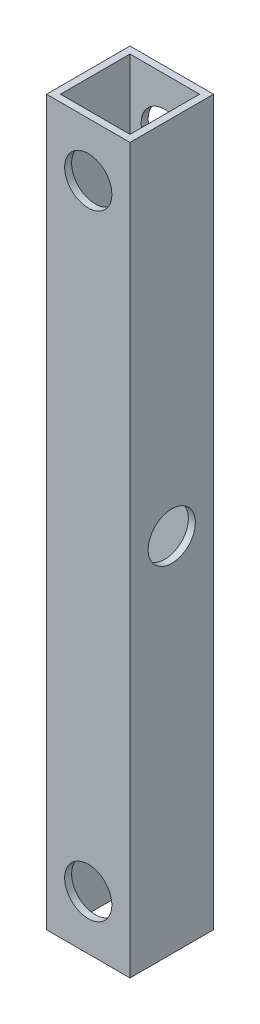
ISO-10303-21;
HEADER;
FILE_DESCRIPTION(('STEP AP214'),'2;1');
FILE_NAME('part.step','',(''),(''),'','','');
FILE_SCHEMA(('AUTOMOTIVE_DESIGN { 1 0 10303 214 1 1 1 1 }'));
ENDSEC;
DATA;
#1=APPLICATION_CONTEXT('core data for automotive mechanical design processes');
#2=APPLICATION_PROTOCOL_DEFINITION('international standard','automotive_design',2000,#1);
#3=PRODUCT_CONTEXT('',#1,'mechanical');
#4=PRODUCT('Part','Part','',(#3));
#5=PRODUCT_RELATED_PRODUCT_CATEGORY('part','',(#4));
#6=PRODUCT_DEFINITION_FORMATION('','',#4);
#7=PRODUCT_DEFINITION_CONTEXT('part definition',#1,'design');
#8=PRODUCT_DEFINITION('design','',#6,#7);
#9=PRODUCT_DEFINITION_SHAPE('','',#8);
#10=(LENGTH_UNIT() NAMED_UNIT(*) SI_UNIT(.MILLI.,.METRE.));
#11=(NAMED_UNIT(*) PLANE_ANGLE_UNIT() SI_UNIT($,.RADIAN.));
#12=(NAMED_UNIT(*) SI_UNIT($,.STERADIAN.) SOLID_ANGLE_UNIT());
#13=UNCERTAINTY_MEASURE_WITH_UNIT(LENGTH_MEASURE(1.E-05),#10,'distance_accuracy_value','');
#14=(GEOMETRIC_REPRESENTATION_CONTEXT(3) GLOBAL_UNCERTAINTY_ASSIGNED_CONTEXT((#13)) GLOBAL_UNIT_ASSIGNED_CONTEXT((#10,
#11,#12)) REPRESENTATION_CONTEXT('',''));
#15=CARTESIAN_POINT('',(0.,0.,0.));
#16=DIRECTION('',(0.,0.,1.));
#17=DIRECTION('',(1.,0.,0.));
#18=AXIS2_PLACEMENT_3D('',#15,#16,#17);
#19=CARTESIAN_POINT('',(0.,165.1,0.));
#20=DIRECTION('',(0.,-1.,0.));
#21=DIRECTION('',(0.,0.,-1.));
#22=AXIS2_PLACEMENT_3D('',#19,#20,#21);
#23=PLANE('',#22);
#24=DIRECTION('',(0.,0.,-1.));
#25=VECTOR('',#24,1.);
#26=CARTESIAN_POINT('',(19.05,165.1,19.05));
#27=LINE('',#26,#25);
#28=CARTESIAN_POINT('',(19.05,165.1,19.05));
#29=VERTEX_POINT('',#28);
#30=CARTESIAN_POINT('',(19.05,165.1,-19.05));
#31=VERTEX_POINT('',#30);
#32=EDGE_CURVE('E138',#29,#31,#27,.T.);
#33=ORIENTED_EDGE('',*,*,#32,.T.);
#34=DIRECTION('',(-1.,0.,0.));
#35=VECTOR('',#34,1.);
#36=CARTESIAN_POINT('',(-19.05,165.1,-19.05));
#37=LINE('',#36,#35);
#38=CARTESIAN_POINT('',(-19.05,165.1,-19.05));
#39=VERTEX_POINT('',#38);
#40=EDGE_CURVE('E141',#31,#39,#37,.T.);
#41=ORIENTED_EDGE('',*,*,#40,.T.);
#42=DIRECTION('',(0.,0.,1.));
#43=VECTOR('',#42,1.);
#44=CARTESIAN_POINT('',(-19.05,165.1,19.05));
#45=LINE('',#44,#43);
#46=CARTESIAN_POINT('',(-19.05,165.1,19.05));
#47=VERTEX_POINT('',#46);
#48=EDGE_CURVE('E144',#39,#47,#45,.T.);
#49=ORIENTED_EDGE('',*,*,#48,.T.);
#50=DIRECTION('',(1.,0.,0.));
#51=VECTOR('',#50,1.);
#52=CARTESIAN_POINT('',(-19.05,165.1,19.05));
#53=LINE('',#52,#51);
#54=EDGE_CURVE('E146',#47,#29,#53,.T.);
#55=ORIENTED_EDGE('',*,*,#54,.T.);
#56=EDGE_LOOP('',(#33,#41,#49,#55));
#57=FACE_BOUND('',#56,.T.);
#58=DIRECTION('',(0.,0.,-1.));
#59=VECTOR('',#58,1.);
#60=CARTESIAN_POINT('',(15.875,165.1,15.875));
#61=LINE('',#60,#59);
#62=CARTESIAN_POINT('',(15.875,165.1,15.875));
#63=VERTEX_POINT('',#62);
#64=CARTESIAN_POINT('',(15.875,165.1,-15.875));
#65=VERTEX_POINT('',#64);
#66=EDGE_CURVE('E100',#63,#65,#61,.T.);
#67=ORIENTED_EDGE('',*,*,#66,.F.);
#68=DIRECTION('',(1.,0.,0.));
#69=VECTOR('',#68,1.);
#70=CARTESIAN_POINT('',(-15.875,165.1,15.875));
#71=LINE('',#70,#69);
#72=CARTESIAN_POINT('',(-15.875,165.1,15.875));
#73=VERTEX_POINT('',#72);
#74=EDGE_CURVE('E122',#73,#63,#71,.T.);
#75=ORIENTED_EDGE('',*,*,#74,.F.);
#76=DIRECTION('',(0.,0.,1.));
#77=VECTOR('',#76,1.);
#78=CARTESIAN_POINT('',(-15.875,165.1,15.875));
#79=LINE('',#78,#77);
#80=CARTESIAN_POINT('',(-15.875,165.1,-15.875));
#81=VERTEX_POINT('',#80);
#82=EDGE_CURVE('E120',#81,#73,#79,.T.);
#83=ORIENTED_EDGE('',*,*,#82,.F.);
#84=DIRECTION('',(-1.,0.,0.));
#85=VECTOR('',#84,1.);
#86=CARTESIAN_POINT('',(-15.875,165.1,-15.875));
#87=LINE('',#86,#85);
#88=EDGE_CURVE('E108',#65,#81,#87,.T.);
#89=ORIENTED_EDGE('',*,*,#88,.F.);
#90=EDGE_LOOP('',(#67,#75,#83,#89));
#91=FACE_BOUND('',#90,.T.);
#92=ADVANCED_FACE('F33',(#57,#91),#23,.F.);
#93=CARTESIAN_POINT('',(0.,-165.1,0.));
#94=DIRECTION('',(0.,-1.,0.));
#95=DIRECTION('',(0.,0.,-1.));
#96=AXIS2_PLACEMENT_3D('',#93,#94,#95);
#97=PLANE('',#96);
#98=DIRECTION('',(0.,0.,-1.));
#99=VECTOR('',#98,1.);
#100=CARTESIAN_POINT('',(19.05,-165.1,19.05));
#101=LINE('',#100,#99);
#102=CARTESIAN_POINT('',(19.05,-165.1,19.05));
#103=VERTEX_POINT('',#102);
#104=CARTESIAN_POINT('',(19.05,-165.1,-19.05));
#105=VERTEX_POINT('',#104);
#106=EDGE_CURVE('E116',#103,#105,#101,.T.);
#107=ORIENTED_EDGE('',*,*,#106,.F.);
#108=DIRECTION('',(1.,0.,0.));
#109=VECTOR('',#108,1.);
#110=CARTESIAN_POINT('',(-19.05,-165.1,19.05));
#111=LINE('',#110,#109);
#112=CARTESIAN_POINT('',(-19.05,-165.1,19.05));
#113=VERTEX_POINT('',#112);
#114=EDGE_CURVE('E142',#113,#103,#111,.T.);
#115=ORIENTED_EDGE('',*,*,#114,.F.);
#116=DIRECTION('',(0.,0.,1.));
#117=VECTOR('',#116,1.);
#118=CARTESIAN_POINT('',(-19.05,-165.1,19.05));
#119=LINE('',#118,#117);
#120=CARTESIAN_POINT('',(-19.05,-165.1,-19.05));
#121=VERTEX_POINT('',#120);
#122=EDGE_CURVE('E153',#121,#113,#119,.T.);
#123=ORIENTED_EDGE('',*,*,#122,.F.);
#124=DIRECTION('',(-1.,0.,0.));
#125=VECTOR('',#124,1.);
#126=CARTESIAN_POINT('',(-19.05,-165.1,-19.05));
#127=LINE('',#126,#125);
#128=EDGE_CURVE('E151',#105,#121,#127,.T.);
#129=ORIENTED_EDGE('',*,*,#128,.F.);
#130=EDGE_LOOP('',(#107,#115,#123,#129));
#131=FACE_BOUND('',#130,.T.);
#132=DIRECTION('',(1.,0.,0.));
#133=VECTOR('',#132,1.);
#134=CARTESIAN_POINT('',(-15.875,-165.1,15.875));
#135=LINE('',#134,#133);
#136=CARTESIAN_POINT('',(-15.875,-165.1,15.875));
#137=VERTEX_POINT('',#136);
#138=CARTESIAN_POINT('',(15.875,-165.1,15.875));
#139=VERTEX_POINT('',#138);
#140=EDGE_CURVE('E109',#137,#139,#135,.T.);
#141=ORIENTED_EDGE('',*,*,#140,.T.);
#142=DIRECTION('',(0.,0.,-1.));
#143=VECTOR('',#142,1.);
#144=CARTESIAN_POINT('',(15.875,-165.1,15.875));
#145=LINE('',#144,#143);
#146=CARTESIAN_POINT('',(15.875,-165.1,-15.875));
#147=VERTEX_POINT('',#146);
#148=EDGE_CURVE('E58',#139,#147,#145,.T.);
#149=ORIENTED_EDGE('',*,*,#148,.T.);
#150=DIRECTION('',(-1.,0.,0.));
#151=VECTOR('',#150,1.);
#152=CARTESIAN_POINT('',(-15.875,-165.1,-15.875));
#153=LINE('',#152,#151);
#154=CARTESIAN_POINT('',(-15.875,-165.1,-15.875));
#155=VERTEX_POINT('',#154);
#156=EDGE_CURVE('E115',#147,#155,#153,.T.);
#157=ORIENTED_EDGE('',*,*,#156,.T.);
#158=DIRECTION('',(0.,0.,1.));
#159=VECTOR('',#158,1.);
#160=CARTESIAN_POINT('',(-15.875,-165.1,15.875));
#161=LINE('',#160,#159);
#162=EDGE_CURVE('E130',#155,#137,#161,.T.);
#163=ORIENTED_EDGE('',*,*,#162,.T.);
#164=EDGE_LOOP('',(#141,#149,#157,#163));
#165=FACE_BOUND('',#164,.T.);
#166=ADVANCED_FACE('F213',(#131,#165),#97,.T.);
#167=CARTESIAN_POINT('',(19.05,165.1,19.05));
#168=DIRECTION('',(-1.,0.,0.));
#169=DIRECTION('',(0.,0.,1.));
#170=AXIS2_PLACEMENT_3D('',#167,#168,#169);
#171=PLANE('',#170);
#172=CARTESIAN_POINT('',(19.05,0.,0.));
#173=DIRECTION('',(1.,0.,0.));
#174=DIRECTION('',(0.,0.,-1.));
#175=AXIS2_PLACEMENT_3D('',#172,#173,#174);
#176=CIRCLE('',#175,10.7696);
#177=CARTESIAN_POINT('',(19.05,0.,-10.7696));
#178=VERTEX_POINT('',#177);
#179=EDGE_CURVE('E285',#178,#178,#176,.T.);
#180=ORIENTED_EDGE('',*,*,#179,.F.);
#181=EDGE_LOOP('',(#180));
#182=FACE_BOUND('',#181,.T.);
#183=ORIENTED_EDGE('',*,*,#106,.T.);
#184=DIRECTION('',(0.,-1.,0.));
#185=VECTOR('',#184,1.);
#186=CARTESIAN_POINT('',(19.05,165.1,-19.05));
#187=LINE('',#186,#185);
#188=EDGE_CURVE('E11',#31,#105,#187,.T.);
#189=ORIENTED_EDGE('',*,*,#188,.F.);
#190=ORIENTED_EDGE('',*,*,#32,.F.);
#191=DIRECTION('',(0.,-1.,0.));
#192=VECTOR('',#191,1.);
#193=CARTESIAN_POINT('',(19.05,165.1,19.05));
#194=LINE('',#193,#192);
#195=EDGE_CURVE('E148',#29,#103,#194,.T.);
#196=ORIENTED_EDGE('',*,*,#195,.T.);
#197=EDGE_LOOP('',(#183,#189,#190,#196));
#198=FACE_BOUND('',#197,.T.);
#199=ADVANCED_FACE('F35',(#182,#198),#171,.F.);
#200=CARTESIAN_POINT('',(-19.05,165.1,-19.05));
#201=DIRECTION('',(0.,0.,1.));
#202=DIRECTION('',(1.,0.,0.));
#203=AXIS2_PLACEMENT_3D('',#200,#201,#202);
#204=PLANE('',#203);
#205=CARTESIAN_POINT('',(0.,-140.425146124,-19.05));
#206=DIRECTION('',(0.,0.,1.));
#207=DIRECTION('',(1.,0.,0.));
#208=AXIS2_PLACEMENT_3D('',#205,#206,#207);
#209=CIRCLE('',#208,10.7696);
#210=CARTESIAN_POINT('',(10.7696,-140.425146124,-19.05));
#211=VERTEX_POINT('',#210);
#212=EDGE_CURVE('E169',#211,#211,#209,.T.);
#213=ORIENTED_EDGE('',*,*,#212,.T.);
#214=EDGE_LOOP('',(#213));
#215=FACE_BOUND('',#214,.T.);
#216=CARTESIAN_POINT('',(0.,140.425146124,-19.05));
#217=DIRECTION('',(0.,0.,1.));
#218=DIRECTION('',(1.,0.,0.));
#219=AXIS2_PLACEMENT_3D('',#216,#217,#218);
#220=CIRCLE('',#219,10.7696);
#221=CARTESIAN_POINT('',(10.7695999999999,140.425146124,-19.05));
#222=VERTEX_POINT('',#221);
#223=EDGE_CURVE('E165',#222,#222,#220,.T.);
#224=ORIENTED_EDGE('',*,*,#223,.T.);
#225=EDGE_LOOP('',(#224));
#226=FACE_BOUND('',#225,.T.);
#227=ORIENTED_EDGE('',*,*,#128,.T.);
#228=DIRECTION('',(0.,-1.,0.));
#229=VECTOR('',#228,1.);
#230=CARTESIAN_POINT('',(-19.05,165.1,-19.05));
#231=LINE('',#230,#229);
#232=EDGE_CURVE('E42',#39,#121,#231,.T.);
#233=ORIENTED_EDGE('',*,*,#232,.F.);
#234=ORIENTED_EDGE('',*,*,#40,.F.);
#235=ORIENTED_EDGE('',*,*,#188,.T.);
#236=EDGE_LOOP('',(#227,#233,#234,#235));
#237=FACE_BOUND('',#236,.T.);
#238=ADVANCED_FACE('F227',(#215,#226,#237),#204,.F.);
#239=CARTESIAN_POINT('',(-19.05,165.1,19.05));
#240=DIRECTION('',(1.,0.,0.));
#241=DIRECTION('',(0.,0.,-1.));
#242=AXIS2_PLACEMENT_3D('',#239,#240,#241);
#243=PLANE('',#242);
#244=CARTESIAN_POINT('',(-19.05,0.,0.));
#245=DIRECTION('',(1.,0.,0.));
#246=DIRECTION('',(0.,0.,-1.));
#247=AXIS2_PLACEMENT_3D('',#244,#245,#246);
#248=CIRCLE('',#247,10.7696);
#249=CARTESIAN_POINT('',(-19.05,0.,-10.7696));
#250=VERTEX_POINT('',#249);
#251=EDGE_CURVE('E284',#250,#250,#248,.T.);
#252=ORIENTED_EDGE('',*,*,#251,.T.);
#253=EDGE_LOOP('',(#252));
#254=FACE_BOUND('',#253,.T.);
#255=ORIENTED_EDGE('',*,*,#122,.T.);
#256=DIRECTION('',(0.,-1.,0.));
#257=VECTOR('',#256,1.);
#258=CARTESIAN_POINT('',(-19.05,165.1,19.05));
#259=LINE('',#258,#257);
#260=EDGE_CURVE('E158',#47,#113,#259,.T.);
#261=ORIENTED_EDGE('',*,*,#260,.F.);
#262=ORIENTED_EDGE('',*,*,#48,.F.);
#263=ORIENTED_EDGE('',*,*,#232,.T.);
#264=EDGE_LOOP('',(#255,#261,#262,#263));
#265=FACE_BOUND('',#264,.T.);
#266=ADVANCED_FACE('F224',(#254,#265),#243,.F.);
#267=CARTESIAN_POINT('',(-19.05,165.1,19.05));
#268=DIRECTION('',(0.,0.,-1.));
#269=DIRECTION('',(-1.,0.,0.));
#270=AXIS2_PLACEMENT_3D('',#267,#268,#269);
#271=PLANE('',#270);
#272=CARTESIAN_POINT('',(0.,-140.425146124,19.05));
#273=DIRECTION('',(0.,0.,1.));
#274=DIRECTION('',(1.,0.,0.));
#275=AXIS2_PLACEMENT_3D('',#272,#273,#274);
#276=CIRCLE('',#275,10.7696);
#277=CARTESIAN_POINT('',(10.7696,-140.425146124,19.05));
#278=VERTEX_POINT('',#277);
#279=EDGE_CURVE('E176',#278,#278,#276,.T.);
#280=ORIENTED_EDGE('',*,*,#279,.F.);
#281=EDGE_LOOP('',(#280));
#282=FACE_BOUND('',#281,.T.);
#283=CARTESIAN_POINT('',(0.,140.425146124,19.05));
#284=DIRECTION('',(0.,0.,1.));
#285=DIRECTION('',(1.,0.,0.));
#286=AXIS2_PLACEMENT_3D('',#283,#284,#285);
#287=CIRCLE('',#286,10.7696);
#288=CARTESIAN_POINT('',(10.7695999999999,140.425146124,19.05));
#289=VERTEX_POINT('',#288);
#290=EDGE_CURVE('E173',#289,#289,#287,.T.);
#291=ORIENTED_EDGE('',*,*,#290,.F.);
#292=EDGE_LOOP('',(#291));
#293=FACE_BOUND('',#292,.T.);
#294=ORIENTED_EDGE('',*,*,#114,.T.);
#295=ORIENTED_EDGE('',*,*,#195,.F.);
#296=ORIENTED_EDGE('',*,*,#54,.F.);
#297=ORIENTED_EDGE('',*,*,#260,.T.);
#298=EDGE_LOOP('',(#294,#295,#296,#297));
#299=FACE_BOUND('',#298,.T.);
#300=ADVANCED_FACE('F208',(#282,#293,#299),#271,.F.);
#301=CARTESIAN_POINT('',(15.875,165.1,15.875));
#302=DIRECTION('',(-1.,0.,0.));
#303=DIRECTION('',(0.,0.,1.));
#304=AXIS2_PLACEMENT_3D('',#301,#302,#303);
#305=PLANE('',#304);
#306=CARTESIAN_POINT('',(15.875,0.,0.));
#307=DIRECTION('',(-1.,0.,0.));
#308=DIRECTION('',(0.,0.,1.));
#309=AXIS2_PLACEMENT_3D('',#306,#307,#308);
#310=CIRCLE('',#309,10.7696);
#311=CARTESIAN_POINT('',(15.875,0.,-10.7696));
#312=VERTEX_POINT('',#311);
#313=EDGE_CURVE('E181',#312,#312,#310,.T.);
#314=ORIENTED_EDGE('',*,*,#313,.F.);
#315=EDGE_LOOP('',(#314));
#316=FACE_BOUND('',#315,.T.);
#317=ORIENTED_EDGE('',*,*,#148,.F.);
#318=DIRECTION('',(0.,-1.,0.));
#319=VECTOR('',#318,1.);
#320=CARTESIAN_POINT('',(15.875,165.1,15.875));
#321=LINE('',#320,#319);
#322=EDGE_CURVE('E104',#63,#139,#321,.T.);
#323=ORIENTED_EDGE('',*,*,#322,.F.);
#324=ORIENTED_EDGE('',*,*,#66,.T.);
#325=DIRECTION('',(0.,-1.,0.));
#326=VECTOR('',#325,1.);
#327=CARTESIAN_POINT('',(15.875,165.1,-15.875));
#328=LINE('',#327,#326);
#329=EDGE_CURVE('E103',#65,#147,#328,.T.);
#330=ORIENTED_EDGE('',*,*,#329,.T.);
#331=EDGE_LOOP('',(#317,#323,#324,#330));
#332=FACE_BOUND('',#331,.T.);
#333=ADVANCED_FACE('F102',(#316,#332),#305,.T.);
#334=CARTESIAN_POINT('',(-15.875,165.1,-15.875));
#335=DIRECTION('',(0.,0.,1.));
#336=DIRECTION('',(1.,0.,0.));
#337=AXIS2_PLACEMENT_3D('',#334,#335,#336);
#338=PLANE('',#337);
#339=CARTESIAN_POINT('',(0.,-140.425146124,-15.875));
#340=DIRECTION('',(0.,0.,1.));
#341=DIRECTION('',(1.,0.,0.));
#342=AXIS2_PLACEMENT_3D('',#339,#340,#341);
#343=CIRCLE('',#342,10.7696);
#344=CARTESIAN_POINT('',(10.7696,-140.425146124,-15.875));
#345=VERTEX_POINT('',#344);
#346=EDGE_CURVE('E168',#345,#345,#343,.T.);
#347=ORIENTED_EDGE('',*,*,#346,.F.);
#348=EDGE_LOOP('',(#347));
#349=FACE_BOUND('',#348,.T.);
#350=CARTESIAN_POINT('',(0.,140.425146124,-15.875));
#351=DIRECTION('',(0.,0.,1.));
#352=DIRECTION('',(1.,0.,0.));
#353=AXIS2_PLACEMENT_3D('',#350,#351,#352);
#354=CIRCLE('',#353,10.7696);
#355=CARTESIAN_POINT('',(10.7695999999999,140.425146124,-15.875));
#356=VERTEX_POINT('',#355);
#357=EDGE_CURVE('E128',#356,#356,#354,.T.);
#358=ORIENTED_EDGE('',*,*,#357,.F.);
#359=EDGE_LOOP('',(#358));
#360=FACE_BOUND('',#359,.T.);
#361=ORIENTED_EDGE('',*,*,#156,.F.);
#362=ORIENTED_EDGE('',*,*,#329,.F.);
#363=ORIENTED_EDGE('',*,*,#88,.T.);
#364=DIRECTION('',(0.,-1.,0.));
#365=VECTOR('',#364,1.);
#366=CARTESIAN_POINT('',(-15.875,165.1,-15.875));
#367=LINE('',#366,#365);
#368=EDGE_CURVE('E117',#81,#155,#367,.T.);
#369=ORIENTED_EDGE('',*,*,#368,.T.);
#370=EDGE_LOOP('',(#361,#362,#363,#369));
#371=FACE_BOUND('',#370,.T.);
#372=ADVANCED_FACE('F112',(#349,#360,#371),#338,.T.);
#373=CARTESIAN_POINT('',(-15.875,165.1,15.875));
#374=DIRECTION('',(1.,0.,0.));
#375=DIRECTION('',(0.,0.,-1.));
#376=AXIS2_PLACEMENT_3D('',#373,#374,#375);
#377=PLANE('',#376);
#378=CARTESIAN_POINT('',(-15.875,0.,0.));
#379=DIRECTION('',(1.,0.,0.));
#380=DIRECTION('',(0.,0.,-1.));
#381=AXIS2_PLACEMENT_3D('',#378,#379,#380);
#382=CIRCLE('',#381,10.7696);
#383=CARTESIAN_POINT('',(-15.875,0.,-10.7696));
#384=VERTEX_POINT('',#383);
#385=EDGE_CURVE('E37',#384,#384,#382,.T.);
#386=ORIENTED_EDGE('',*,*,#385,.F.);
#387=EDGE_LOOP('',(#386));
#388=FACE_BOUND('',#387,.T.);
#389=ORIENTED_EDGE('',*,*,#162,.F.);
#390=ORIENTED_EDGE('',*,*,#368,.F.);
#391=ORIENTED_EDGE('',*,*,#82,.T.);
#392=DIRECTION('',(0.,-1.,0.));
#393=VECTOR('',#392,1.);
#394=CARTESIAN_POINT('',(-15.875,165.1,15.875));
#395=LINE('',#394,#393);
#396=EDGE_CURVE('E50',#73,#137,#395,.T.);
#397=ORIENTED_EDGE('',*,*,#396,.T.);
#398=EDGE_LOOP('',(#389,#390,#391,#397));
#399=FACE_BOUND('',#398,.T.);
#400=ADVANCED_FACE('F196',(#388,#399),#377,.T.);
#401=CARTESIAN_POINT('',(-15.875,165.1,15.875));
#402=DIRECTION('',(0.,0.,-1.));
#403=DIRECTION('',(-1.,0.,0.));
#404=AXIS2_PLACEMENT_3D('',#401,#402,#403);
#405=PLANE('',#404);
#406=CARTESIAN_POINT('',(0.,-140.425146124,15.875));
#407=DIRECTION('',(0.,0.,-1.));
#408=DIRECTION('',(-1.,0.,0.));
#409=AXIS2_PLACEMENT_3D('',#406,#407,#408);
#410=CIRCLE('',#409,10.7696);
#411=CARTESIAN_POINT('',(10.7696,-140.425146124,15.875));
#412=VERTEX_POINT('',#411);
#413=EDGE_CURVE('E166',#412,#412,#410,.T.);
#414=ORIENTED_EDGE('',*,*,#413,.F.);
#415=EDGE_LOOP('',(#414));
#416=FACE_BOUND('',#415,.T.);
#417=CARTESIAN_POINT('',(0.,140.425146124,15.875));
#418=DIRECTION('',(0.,0.,-1.));
#419=DIRECTION('',(-1.,0.,0.));
#420=AXIS2_PLACEMENT_3D('',#417,#418,#419);
#421=CIRCLE('',#420,10.7696);
#422=CARTESIAN_POINT('',(10.7695999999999,140.425146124,15.875));
#423=VERTEX_POINT('',#422);
#424=EDGE_CURVE('E163',#423,#423,#421,.T.);
#425=ORIENTED_EDGE('',*,*,#424,.F.);
#426=EDGE_LOOP('',(#425));
#427=FACE_BOUND('',#426,.T.);
#428=ORIENTED_EDGE('',*,*,#140,.F.);
#429=ORIENTED_EDGE('',*,*,#396,.F.);
#430=ORIENTED_EDGE('',*,*,#74,.T.);
#431=ORIENTED_EDGE('',*,*,#322,.T.);
#432=EDGE_LOOP('',(#428,#429,#430,#431));
#433=FACE_BOUND('',#432,.T.);
#434=ADVANCED_FACE('F204',(#416,#427,#433),#405,.T.);
#435=CARTESIAN_POINT('',(0.,140.425146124,-19.05));
#436=DIRECTION('',(0.,0.,1.));
#437=DIRECTION('',(1.,0.,0.));
#438=AXIS2_PLACEMENT_3D('',#435,#436,#437);
#439=CYLINDRICAL_SURFACE('',#438,10.7696);
#440=CARTESIAN_POINT('',(10.7695999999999,140.425146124,15.875));
#441=CARTESIAN_POINT('',(10.7695999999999,140.425146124,15.9080729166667));
#442=CARTESIAN_POINT('',(10.7695999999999,140.425146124,15.9411458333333));
#443=CARTESIAN_POINT('',(10.7695999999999,140.425146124,16.0072916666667));
#444=CARTESIAN_POINT('',(10.7695999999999,140.425146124,16.0403645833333));
#445=CARTESIAN_POINT('',(10.7695999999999,140.425146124,16.1065104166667));
#446=CARTESIAN_POINT('',(10.7695999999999,140.425146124,16.1395833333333));
#447=CARTESIAN_POINT('',(10.7695999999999,140.425146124,16.2057291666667));
#448=CARTESIAN_POINT('',(10.7695999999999,140.425146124,16.2388020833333));
#449=CARTESIAN_POINT('',(10.7695999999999,140.425146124,16.3049479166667));
#450=CARTESIAN_POINT('',(10.7695999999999,140.425146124,16.3380208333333));
#451=CARTESIAN_POINT('',(10.7695999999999,140.425146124,16.4041666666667));
#452=CARTESIAN_POINT('',(10.7695999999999,140.425146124,16.4372395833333));
#453=CARTESIAN_POINT('',(10.7695999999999,140.425146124,16.5033854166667));
#454=CARTESIAN_POINT('',(10.7695999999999,140.425146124,16.5364583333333));
#455=CARTESIAN_POINT('',(10.7695999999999,140.425146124,16.6026041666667));
#456=CARTESIAN_POINT('',(10.7695999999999,140.425146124,16.6356770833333));
#457=CARTESIAN_POINT('',(10.7695999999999,140.425146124,16.7018229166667));
#458=CARTESIAN_POINT('',(10.7695999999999,140.425146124,16.7348958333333));
#459=CARTESIAN_POINT('',(10.7695999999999,140.425146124,16.8010416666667));
#460=CARTESIAN_POINT('',(10.7695999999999,140.425146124,16.8341145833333));
#461=CARTESIAN_POINT('',(10.7695999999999,140.425146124,16.9002604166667));
#462=CARTESIAN_POINT('',(10.7695999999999,140.425146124,16.9333333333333));
#463=CARTESIAN_POINT('',(10.7695999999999,140.425146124,16.9994791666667));
#464=CARTESIAN_POINT('',(10.7695999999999,140.425146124,17.0325520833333));
#465=CARTESIAN_POINT('',(10.7695999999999,140.425146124,17.0986979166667));
#466=CARTESIAN_POINT('',(10.7695999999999,140.425146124,17.1317708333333));
#467=CARTESIAN_POINT('',(10.7695999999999,140.425146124,17.1979166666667));
#468=CARTESIAN_POINT('',(10.7695999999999,140.425146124,17.2309895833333));
#469=CARTESIAN_POINT('',(10.7695999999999,140.425146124,17.2971354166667));
#470=CARTESIAN_POINT('',(10.7695999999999,140.425146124,17.3302083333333));
#471=CARTESIAN_POINT('',(10.7695999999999,140.425146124,17.3963541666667));
#472=CARTESIAN_POINT('',(10.7695999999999,140.425146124,17.4294270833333));
#473=CARTESIAN_POINT('',(10.7695999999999,140.425146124,17.4955729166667));
#474=CARTESIAN_POINT('',(10.7695999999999,140.425146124,17.5286458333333));
#475=CARTESIAN_POINT('',(10.7695999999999,140.425146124,17.5947916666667));
#476=CARTESIAN_POINT('',(10.7695999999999,140.425146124,17.6278645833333));
#477=CARTESIAN_POINT('',(10.7695999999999,140.425146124,17.6940104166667));
#478=CARTESIAN_POINT('',(10.7695999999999,140.425146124,17.7270833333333));
#479=CARTESIAN_POINT('',(10.7695999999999,140.425146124,17.7932291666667));
#480=CARTESIAN_POINT('',(10.7695999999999,140.425146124,17.8263020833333));
#481=CARTESIAN_POINT('',(10.7695999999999,140.425146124,17.8924479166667));
#482=CARTESIAN_POINT('',(10.7695999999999,140.425146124,17.9255208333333));
#483=CARTESIAN_POINT('',(10.7695999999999,140.425146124,17.9916666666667));
#484=CARTESIAN_POINT('',(10.7695999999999,140.425146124,18.0247395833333));
#485=CARTESIAN_POINT('',(10.7695999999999,140.425146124,18.0908854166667));
#486=CARTESIAN_POINT('',(10.7695999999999,140.425146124,18.1239583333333));
#487=CARTESIAN_POINT('',(10.7695999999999,140.425146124,18.1901041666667));
#488=CARTESIAN_POINT('',(10.7695999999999,140.425146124,18.2231770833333));
#489=CARTESIAN_POINT('',(10.7695999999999,140.425146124,18.2893229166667));
#490=CARTESIAN_POINT('',(10.7695999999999,140.425146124,18.3223958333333));
#491=CARTESIAN_POINT('',(10.7695999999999,140.425146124,18.3885416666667));
#492=CARTESIAN_POINT('',(10.7695999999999,140.425146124,18.4216145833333));
#493=CARTESIAN_POINT('',(10.7695999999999,140.425146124,18.4877604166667));
#494=CARTESIAN_POINT('',(10.7695999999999,140.425146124,18.5208333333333));
#495=CARTESIAN_POINT('',(10.7695999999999,140.425146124,18.5869791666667));
#496=CARTESIAN_POINT('',(10.7695999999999,140.425146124,18.6200520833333));
#497=CARTESIAN_POINT('',(10.7695999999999,140.425146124,18.6861979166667));
#498=CARTESIAN_POINT('',(10.7695999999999,140.425146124,18.7192708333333));
#499=CARTESIAN_POINT('',(10.7695999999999,140.425146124,18.7854166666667));
#500=CARTESIAN_POINT('',(10.7695999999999,140.425146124,18.8184895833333));
#501=CARTESIAN_POINT('',(10.7695999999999,140.425146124,18.8846354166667));
#502=CARTESIAN_POINT('',(10.7695999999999,140.425146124,18.9177083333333));
#503=CARTESIAN_POINT('',(10.7695999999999,140.425146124,18.9838541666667));
#504=CARTESIAN_POINT('',(10.7695999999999,140.425146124,19.0169270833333));
#505=CARTESIAN_POINT('',(10.7695999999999,140.425146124,19.05));
#506=B_SPLINE_CURVE_WITH_KNOTS('',3,(#440,#441,#442,#443,#444,#445,#446,#447,#448,#449,#450,
#451,#452,#453,#454,#455,#456,#457,#458,#459,#460,#461,#462,#463,#464,#465,#466,#467,#468,#469,
#470,#471,#472,#473,#474,#475,#476,#477,#478,#479,#480,#481,#482,#483,#484,#485,#486,#487,#488,
#489,#490,#491,#492,#493,#494,#495,#496,#497,#498,#499,#500,#501,#502,#503,#504,#505),
.UNSPECIFIED.,.F.,.F.,(4,2,2,2,2,2,2,2,2,2,2,2,2,2,2,2,2,2,2,2,2,2,2,2,2,2,2,2,2,2,2,2,4),(0.,
0.0992187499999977,0.198437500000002,0.29765625,0.396874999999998,0.496093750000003,0.5953125,
0.694531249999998,0.793749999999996,0.892968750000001,0.992187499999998,1.09140625,1.190625,
1.28984375,1.3890625,1.48828125,1.5875,1.68671875,1.7859375,1.88515625,1.984375,2.08359375,
2.1828125,2.28203125,2.38125,2.48046875,2.5796875,2.67890624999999,2.778125,2.87734375,
2.97656249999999,3.07578125,3.175),.UNSPECIFIED.);
#507=EDGE_CURVE('BSEAM255',#423,#289,#506,.T.);
#508=ORIENTED_EDGE('',*,*,#424,.T.);
#509=ORIENTED_EDGE('',*,*,#290,.T.);
#510=ORIENTED_EDGE('',*,*,#507,.T.);
#511=ORIENTED_EDGE('',*,*,#507,.F.);
#512=EDGE_LOOP('',(#508,#510,#509,#511));
#513=FACE_BOUND('',#512,.T.);
#514=ADVANCED_FACE('F255',(#513),#439,.F.);
#515=CARTESIAN_POINT('',(10.7695999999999,140.425146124,-15.875));
#516=CARTESIAN_POINT('',(10.7695999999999,140.425146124,-15.9080729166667));
#517=CARTESIAN_POINT('',(10.7695999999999,140.425146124,-15.9411458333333));
#518=CARTESIAN_POINT('',(10.7695999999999,140.425146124,-16.0072916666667));
#519=CARTESIAN_POINT('',(10.7695999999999,140.425146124,-16.0403645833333));
#520=CARTESIAN_POINT('',(10.7695999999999,140.425146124,-16.1065104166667));
#521=CARTESIAN_POINT('',(10.7695999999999,140.425146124,-16.1395833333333));
#522=CARTESIAN_POINT('',(10.7695999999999,140.425146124,-16.2057291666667));
#523=CARTESIAN_POINT('',(10.7695999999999,140.425146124,-16.2388020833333));
#524=CARTESIAN_POINT('',(10.7695999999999,140.425146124,-16.3049479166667));
#525=CARTESIAN_POINT('',(10.7695999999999,140.425146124,-16.3380208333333));
#526=CARTESIAN_POINT('',(10.7695999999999,140.425146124,-16.4041666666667));
#527=CARTESIAN_POINT('',(10.7695999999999,140.425146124,-16.4372395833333));
#528=CARTESIAN_POINT('',(10.7695999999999,140.425146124,-16.5033854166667));
#529=CARTESIAN_POINT('',(10.7695999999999,140.425146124,-16.5364583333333));
#530=CARTESIAN_POINT('',(10.7695999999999,140.425146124,-16.6026041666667));
#531=CARTESIAN_POINT('',(10.7695999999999,140.425146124,-16.6356770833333));
#532=CARTESIAN_POINT('',(10.7695999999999,140.425146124,-16.7018229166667));
#533=CARTESIAN_POINT('',(10.7695999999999,140.425146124,-16.7348958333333));
#534=CARTESIAN_POINT('',(10.7695999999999,140.425146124,-16.8010416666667));
#535=CARTESIAN_POINT('',(10.7695999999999,140.425146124,-16.8341145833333));
#536=CARTESIAN_POINT('',(10.7695999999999,140.425146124,-16.9002604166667));
#537=CARTESIAN_POINT('',(10.7695999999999,140.425146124,-16.9333333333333));
#538=CARTESIAN_POINT('',(10.7695999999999,140.425146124,-16.9994791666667));
#539=CARTESIAN_POINT('',(10.7695999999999,140.425146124,-17.0325520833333));
#540=CARTESIAN_POINT('',(10.7695999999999,140.425146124,-17.0986979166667));
#541=CARTESIAN_POINT('',(10.7695999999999,140.425146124,-17.1317708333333));
#542=CARTESIAN_POINT('',(10.7695999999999,140.425146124,-17.1979166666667));
#543=CARTESIAN_POINT('',(10.7695999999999,140.425146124,-17.2309895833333));
#544=CARTESIAN_POINT('',(10.7695999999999,140.425146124,-17.2971354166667));
#545=CARTESIAN_POINT('',(10.7695999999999,140.425146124,-17.3302083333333));
#546=CARTESIAN_POINT('',(10.7695999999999,140.425146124,-17.3963541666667));
#547=CARTESIAN_POINT('',(10.7695999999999,140.425146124,-17.4294270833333));
#548=CARTESIAN_POINT('',(10.7695999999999,140.425146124,-17.4955729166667));
#549=CARTESIAN_POINT('',(10.7695999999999,140.425146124,-17.5286458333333));
#550=CARTESIAN_POINT('',(10.7695999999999,140.425146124,-17.5947916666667));
#551=CARTESIAN_POINT('',(10.7695999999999,140.425146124,-17.6278645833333));
#552=CARTESIAN_POINT('',(10.7695999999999,140.425146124,-17.6940104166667));
#553=CARTESIAN_POINT('',(10.7695999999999,140.425146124,-17.7270833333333));
#554=CARTESIAN_POINT('',(10.7695999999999,140.425146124,-17.7932291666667));
#555=CARTESIAN_POINT('',(10.7695999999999,140.425146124,-17.8263020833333));
#556=CARTESIAN_POINT('',(10.7695999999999,140.425146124,-17.8924479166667));
#557=CARTESIAN_POINT('',(10.7695999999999,140.425146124,-17.9255208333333));
#558=CARTESIAN_POINT('',(10.7695999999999,140.425146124,-17.9916666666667));
#559=CARTESIAN_POINT('',(10.7695999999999,140.425146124,-18.0247395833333));
#560=CARTESIAN_POINT('',(10.7695999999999,140.425146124,-18.0908854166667));
#561=CARTESIAN_POINT('',(10.7695999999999,140.425146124,-18.1239583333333));
#562=CARTESIAN_POINT('',(10.7695999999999,140.425146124,-18.1901041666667));
#563=CARTESIAN_POINT('',(10.7695999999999,140.425146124,-18.2231770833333));
#564=CARTESIAN_POINT('',(10.7695999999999,140.425146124,-18.2893229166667));
#565=CARTESIAN_POINT('',(10.7695999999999,140.425146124,-18.3223958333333));
#566=CARTESIAN_POINT('',(10.7695999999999,140.425146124,-18.3885416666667));
#567=CARTESIAN_POINT('',(10.7695999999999,140.425146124,-18.4216145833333));
#568=CARTESIAN_POINT('',(10.7695999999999,140.425146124,-18.4877604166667));
#569=CARTESIAN_POINT('',(10.7695999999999,140.425146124,-18.5208333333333));
#570=CARTESIAN_POINT('',(10.7695999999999,140.425146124,-18.5869791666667));
#571=CARTESIAN_POINT('',(10.7695999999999,140.425146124,-18.6200520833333));
#572=CARTESIAN_POINT('',(10.7695999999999,140.425146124,-18.6861979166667));
#573=CARTESIAN_POINT('',(10.7695999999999,140.425146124,-18.7192708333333));
#574=CARTESIAN_POINT('',(10.7695999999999,140.425146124,-18.7854166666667));
#575=CARTESIAN_POINT('',(10.7695999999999,140.425146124,-18.8184895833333));
#576=CARTESIAN_POINT('',(10.7695999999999,140.425146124,-18.8846354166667));
#577=CARTESIAN_POINT('',(10.7695999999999,140.425146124,-18.9177083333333));
#578=CARTESIAN_POINT('',(10.7695999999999,140.425146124,-18.9838541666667));
#579=CARTESIAN_POINT('',(10.7695999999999,140.425146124,-19.0169270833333));
#580=CARTESIAN_POINT('',(10.7695999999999,140.425146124,-19.05));
#581=B_SPLINE_CURVE_WITH_KNOTS('',3,(#515,#516,#517,#518,#519,#520,#521,#522,#523,#524,#525,
#526,#527,#528,#529,#530,#531,#532,#533,#534,#535,#536,#537,#538,#539,#540,#541,#542,#543,#544,
#545,#546,#547,#548,#549,#550,#551,#552,#553,#554,#555,#556,#557,#558,#559,#560,#561,#562,#563,
#564,#565,#566,#567,#568,#569,#570,#571,#572,#573,#574,#575,#576,#577,#578,#579,#580),
.UNSPECIFIED.,.F.,.F.,(4,2,2,2,2,2,2,2,2,2,2,2,2,2,2,2,2,2,2,2,2,2,2,2,2,2,2,2,2,2,2,2,4),(0.,
0.0992187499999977,0.198437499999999,0.29765625,0.396874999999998,0.496093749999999,0.5953125,
0.694531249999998,0.793749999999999,0.892968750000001,0.992187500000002,1.09140625,1.190625,
1.28984375,1.3890625,1.48828125,1.5875,1.68671875,1.7859375,1.88515625,1.984375,2.08359375,
2.1828125,2.28203125,2.38125,2.48046875,2.5796875,2.67890625,2.778125,2.87734375,2.9765625,
3.07578125,3.175),.UNSPECIFIED.);
#582=EDGE_CURVE('BSEAM192',#356,#222,#581,.T.);
#583=ORIENTED_EDGE('',*,*,#357,.T.);
#584=ORIENTED_EDGE('',*,*,#223,.F.);
#585=ORIENTED_EDGE('',*,*,#582,.T.);
#586=ORIENTED_EDGE('',*,*,#582,.F.);
#587=EDGE_LOOP('',(#583,#585,#584,#586));
#588=FACE_BOUND('',#587,.T.);
#589=ADVANCED_FACE('F192',(#588),#439,.F.);
#590=CARTESIAN_POINT('',(0.,-140.425146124,-19.05));
#591=DIRECTION('',(0.,0.,1.));
#592=DIRECTION('',(1.,0.,0.));
#593=AXIS2_PLACEMENT_3D('',#590,#591,#592);
#594=CYLINDRICAL_SURFACE('',#593,10.7696);
#595=CARTESIAN_POINT('',(10.7696,-140.425146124,15.875));
#596=CARTESIAN_POINT('',(10.7696,-140.425146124,15.9080729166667));
#597=CARTESIAN_POINT('',(10.7696,-140.425146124,15.9411458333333));
#598=CARTESIAN_POINT('',(10.7696,-140.425146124,16.0072916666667));
#599=CARTESIAN_POINT('',(10.7696,-140.425146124,16.0403645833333));
#600=CARTESIAN_POINT('',(10.7696,-140.425146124,16.1065104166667));
#601=CARTESIAN_POINT('',(10.7696,-140.425146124,16.1395833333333));
#602=CARTESIAN_POINT('',(10.7696,-140.425146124,16.2057291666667));
#603=CARTESIAN_POINT('',(10.7696,-140.425146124,16.2388020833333));
#604=CARTESIAN_POINT('',(10.7696,-140.425146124,16.3049479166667));
#605=CARTESIAN_POINT('',(10.7696,-140.425146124,16.3380208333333));
#606=CARTESIAN_POINT('',(10.7696,-140.425146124,16.4041666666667));
#607=CARTESIAN_POINT('',(10.7696,-140.425146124,16.4372395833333));
#608=CARTESIAN_POINT('',(10.7696,-140.425146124,16.5033854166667));
#609=CARTESIAN_POINT('',(10.7696,-140.425146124,16.5364583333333));
#610=CARTESIAN_POINT('',(10.7696,-140.425146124,16.6026041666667));
#611=CARTESIAN_POINT('',(10.7696,-140.425146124,16.6356770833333));
#612=CARTESIAN_POINT('',(10.7696,-140.425146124,16.7018229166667));
#613=CARTESIAN_POINT('',(10.7696,-140.425146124,16.7348958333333));
#614=CARTESIAN_POINT('',(10.7696,-140.425146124,16.8010416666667));
#615=CARTESIAN_POINT('',(10.7696,-140.425146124,16.8341145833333));
#616=CARTESIAN_POINT('',(10.7696,-140.425146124,16.9002604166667));
#617=CARTESIAN_POINT('',(10.7696,-140.425146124,16.9333333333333));
#618=CARTESIAN_POINT('',(10.7696,-140.425146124,16.9994791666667));
#619=CARTESIAN_POINT('',(10.7696,-140.425146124,17.0325520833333));
#620=CARTESIAN_POINT('',(10.7696,-140.425146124,17.0986979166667));
#621=CARTESIAN_POINT('',(10.7696,-140.425146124,17.1317708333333));
#622=CARTESIAN_POINT('',(10.7696,-140.425146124,17.1979166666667));
#623=CARTESIAN_POINT('',(10.7696,-140.425146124,17.2309895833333));
#624=CARTESIAN_POINT('',(10.7696,-140.425146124,17.2971354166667));
#625=CARTESIAN_POINT('',(10.7696,-140.425146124,17.3302083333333));
#626=CARTESIAN_POINT('',(10.7696,-140.425146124,17.3963541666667));
#627=CARTESIAN_POINT('',(10.7696,-140.425146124,17.4294270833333));
#628=CARTESIAN_POINT('',(10.7696,-140.425146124,17.4955729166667));
#629=CARTESIAN_POINT('',(10.7696,-140.425146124,17.5286458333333));
#630=CARTESIAN_POINT('',(10.7696,-140.425146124,17.5947916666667));
#631=CARTESIAN_POINT('',(10.7696,-140.425146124,17.6278645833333));
#632=CARTESIAN_POINT('',(10.7696,-140.425146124,17.6940104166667));
#633=CARTESIAN_POINT('',(10.7696,-140.425146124,17.7270833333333));
#634=CARTESIAN_POINT('',(10.7696,-140.425146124,17.7932291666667));
#635=CARTESIAN_POINT('',(10.7696,-140.425146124,17.8263020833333));
#636=CARTESIAN_POINT('',(10.7696,-140.425146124,17.8924479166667));
#637=CARTESIAN_POINT('',(10.7696,-140.425146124,17.9255208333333));
#638=CARTESIAN_POINT('',(10.7696,-140.425146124,17.9916666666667));
#639=CARTESIAN_POINT('',(10.7696,-140.425146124,18.0247395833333));
#640=CARTESIAN_POINT('',(10.7696,-140.425146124,18.0908854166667));
#641=CARTESIAN_POINT('',(10.7696,-140.425146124,18.1239583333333));
#642=CARTESIAN_POINT('',(10.7696,-140.425146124,18.1901041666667));
#643=CARTESIAN_POINT('',(10.7696,-140.425146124,18.2231770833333));
#644=CARTESIAN_POINT('',(10.7696,-140.425146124,18.2893229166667));
#645=CARTESIAN_POINT('',(10.7696,-140.425146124,18.3223958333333));
#646=CARTESIAN_POINT('',(10.7696,-140.425146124,18.3885416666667));
#647=CARTESIAN_POINT('',(10.7696,-140.425146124,18.4216145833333));
#648=CARTESIAN_POINT('',(10.7696,-140.425146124,18.4877604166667));
#649=CARTESIAN_POINT('',(10.7696,-140.425146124,18.5208333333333));
#650=CARTESIAN_POINT('',(10.7696,-140.425146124,18.5869791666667));
#651=CARTESIAN_POINT('',(10.7696,-140.425146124,18.6200520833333));
#652=CARTESIAN_POINT('',(10.7696,-140.425146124,18.6861979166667));
#653=CARTESIAN_POINT('',(10.7696,-140.425146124,18.7192708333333));
#654=CARTESIAN_POINT('',(10.7696,-140.425146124,18.7854166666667));
#655=CARTESIAN_POINT('',(10.7696,-140.425146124,18.8184895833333));
#656=CARTESIAN_POINT('',(10.7696,-140.425146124,18.8846354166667));
#657=CARTESIAN_POINT('',(10.7696,-140.425146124,18.9177083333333));
#658=CARTESIAN_POINT('',(10.7696,-140.425146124,18.9838541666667));
#659=CARTESIAN_POINT('',(10.7696,-140.425146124,19.0169270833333));
#660=CARTESIAN_POINT('',(10.7696,-140.425146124,19.05));
#661=B_SPLINE_CURVE_WITH_KNOTS('',3,(#595,#596,#597,#598,#599,#600,#601,#602,#603,#604,#605,
#606,#607,#608,#609,#610,#611,#612,#613,#614,#615,#616,#617,#618,#619,#620,#621,#622,#623,#624,
#625,#626,#627,#628,#629,#630,#631,#632,#633,#634,#635,#636,#637,#638,#639,#640,#641,#642,#643,
#644,#645,#646,#647,#648,#649,#650,#651,#652,#653,#654,#655,#656,#657,#658,#659,#660),
.UNSPECIFIED.,.F.,.F.,(4,2,2,2,2,2,2,2,2,2,2,2,2,2,2,2,2,2,2,2,2,2,2,2,2,2,2,2,2,2,2,2,4),(0.,
0.0992187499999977,0.198437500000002,0.29765625,0.396874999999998,0.496093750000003,0.5953125,
0.694531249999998,0.793749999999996,0.892968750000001,0.992187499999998,1.09140625,1.190625,
1.28984375,1.3890625,1.48828125,1.5875,1.68671875,1.7859375,1.88515625,1.984375,2.08359375,
2.1828125,2.28203125,2.38125,2.48046875,2.5796875,2.67890624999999,2.778125,2.87734375,
2.97656249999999,3.07578125,3.175),.UNSPECIFIED.);
#662=EDGE_CURVE('BSEAM265',#412,#278,#661,.T.);
#663=ORIENTED_EDGE('',*,*,#413,.T.);
#664=ORIENTED_EDGE('',*,*,#279,.T.);
#665=ORIENTED_EDGE('',*,*,#662,.T.);
#666=ORIENTED_EDGE('',*,*,#662,.F.);
#667=EDGE_LOOP('',(#663,#665,#664,#666));
#668=FACE_BOUND('',#667,.T.);
#669=ADVANCED_FACE('F265',(#668),#594,.F.);
#670=CARTESIAN_POINT('',(10.7696,-140.425146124,-15.875));
#671=CARTESIAN_POINT('',(10.7696,-140.425146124,-15.9080729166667));
#672=CARTESIAN_POINT('',(10.7696,-140.425146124,-15.9411458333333));
#673=CARTESIAN_POINT('',(10.7696,-140.425146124,-16.0072916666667));
#674=CARTESIAN_POINT('',(10.7696,-140.425146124,-16.0403645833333));
#675=CARTESIAN_POINT('',(10.7696,-140.425146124,-16.1065104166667));
#676=CARTESIAN_POINT('',(10.7696,-140.425146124,-16.1395833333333));
#677=CARTESIAN_POINT('',(10.7696,-140.425146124,-16.2057291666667));
#678=CARTESIAN_POINT('',(10.7696,-140.425146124,-16.2388020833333));
#679=CARTESIAN_POINT('',(10.7696,-140.425146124,-16.3049479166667));
#680=CARTESIAN_POINT('',(10.7696,-140.425146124,-16.3380208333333));
#681=CARTESIAN_POINT('',(10.7696,-140.425146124,-16.4041666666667));
#682=CARTESIAN_POINT('',(10.7696,-140.425146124,-16.4372395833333));
#683=CARTESIAN_POINT('',(10.7696,-140.425146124,-16.5033854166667));
#684=CARTESIAN_POINT('',(10.7696,-140.425146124,-16.5364583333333));
#685=CARTESIAN_POINT('',(10.7696,-140.425146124,-16.6026041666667));
#686=CARTESIAN_POINT('',(10.7696,-140.425146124,-16.6356770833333));
#687=CARTESIAN_POINT('',(10.7696,-140.425146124,-16.7018229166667));
#688=CARTESIAN_POINT('',(10.7696,-140.425146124,-16.7348958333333));
#689=CARTESIAN_POINT('',(10.7696,-140.425146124,-16.8010416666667));
#690=CARTESIAN_POINT('',(10.7696,-140.425146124,-16.8341145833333));
#691=CARTESIAN_POINT('',(10.7696,-140.425146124,-16.9002604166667));
#692=CARTESIAN_POINT('',(10.7696,-140.425146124,-16.9333333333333));
#693=CARTESIAN_POINT('',(10.7696,-140.425146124,-16.9994791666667));
#694=CARTESIAN_POINT('',(10.7696,-140.425146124,-17.0325520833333));
#695=CARTESIAN_POINT('',(10.7696,-140.425146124,-17.0986979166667));
#696=CARTESIAN_POINT('',(10.7696,-140.425146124,-17.1317708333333));
#697=CARTESIAN_POINT('',(10.7696,-140.425146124,-17.1979166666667));
#698=CARTESIAN_POINT('',(10.7696,-140.425146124,-17.2309895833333));
#699=CARTESIAN_POINT('',(10.7696,-140.425146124,-17.2971354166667));
#700=CARTESIAN_POINT('',(10.7696,-140.425146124,-17.3302083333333));
#701=CARTESIAN_POINT('',(10.7696,-140.425146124,-17.3963541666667));
#702=CARTESIAN_POINT('',(10.7696,-140.425146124,-17.4294270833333));
#703=CARTESIAN_POINT('',(10.7696,-140.425146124,-17.4955729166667));
#704=CARTESIAN_POINT('',(10.7696,-140.425146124,-17.5286458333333));
#705=CARTESIAN_POINT('',(10.7696,-140.425146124,-17.5947916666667));
#706=CARTESIAN_POINT('',(10.7696,-140.425146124,-17.6278645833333));
#707=CARTESIAN_POINT('',(10.7696,-140.425146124,-17.6940104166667));
#708=CARTESIAN_POINT('',(10.7696,-140.425146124,-17.7270833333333));
#709=CARTESIAN_POINT('',(10.7696,-140.425146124,-17.7932291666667));
#710=CARTESIAN_POINT('',(10.7696,-140.425146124,-17.8263020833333));
#711=CARTESIAN_POINT('',(10.7696,-140.425146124,-17.8924479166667));
#712=CARTESIAN_POINT('',(10.7696,-140.425146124,-17.9255208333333));
#713=CARTESIAN_POINT('',(10.7696,-140.425146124,-17.9916666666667));
#714=CARTESIAN_POINT('',(10.7696,-140.425146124,-18.0247395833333));
#715=CARTESIAN_POINT('',(10.7696,-140.425146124,-18.0908854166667));
#716=CARTESIAN_POINT('',(10.7696,-140.425146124,-18.1239583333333));
#717=CARTESIAN_POINT('',(10.7696,-140.425146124,-18.1901041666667));
#718=CARTESIAN_POINT('',(10.7696,-140.425146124,-18.2231770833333));
#719=CARTESIAN_POINT('',(10.7696,-140.425146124,-18.2893229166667));
#720=CARTESIAN_POINT('',(10.7696,-140.425146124,-18.3223958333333));
#721=CARTESIAN_POINT('',(10.7696,-140.425146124,-18.3885416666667));
#722=CARTESIAN_POINT('',(10.7696,-140.425146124,-18.4216145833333));
#723=CARTESIAN_POINT('',(10.7696,-140.425146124,-18.4877604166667));
#724=CARTESIAN_POINT('',(10.7696,-140.425146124,-18.5208333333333));
#725=CARTESIAN_POINT('',(10.7696,-140.425146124,-18.5869791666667));
#726=CARTESIAN_POINT('',(10.7696,-140.425146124,-18.6200520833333));
#727=CARTESIAN_POINT('',(10.7696,-140.425146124,-18.6861979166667));
#728=CARTESIAN_POINT('',(10.7696,-140.425146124,-18.7192708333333));
#729=CARTESIAN_POINT('',(10.7696,-140.425146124,-18.7854166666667));
#730=CARTESIAN_POINT('',(10.7696,-140.425146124,-18.8184895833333));
#731=CARTESIAN_POINT('',(10.7696,-140.425146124,-18.8846354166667));
#732=CARTESIAN_POINT('',(10.7696,-140.425146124,-18.9177083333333));
#733=CARTESIAN_POINT('',(10.7696,-140.425146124,-18.9838541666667));
#734=CARTESIAN_POINT('',(10.7696,-140.425146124,-19.0169270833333));
#735=CARTESIAN_POINT('',(10.7696,-140.425146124,-19.05));
#736=B_SPLINE_CURVE_WITH_KNOTS('',3,(#670,#671,#672,#673,#674,#675,#676,#677,#678,#679,#680,
#681,#682,#683,#684,#685,#686,#687,#688,#689,#690,#691,#692,#693,#694,#695,#696,#697,#698,#699,
#700,#701,#702,#703,#704,#705,#706,#707,#708,#709,#710,#711,#712,#713,#714,#715,#716,#717,#718,
#719,#720,#721,#722,#723,#724,#725,#726,#727,#728,#729,#730,#731,#732,#733,#734,#735),
.UNSPECIFIED.,.F.,.F.,(4,2,2,2,2,2,2,2,2,2,2,2,2,2,2,2,2,2,2,2,2,2,2,2,2,2,2,2,2,2,2,2,4),(0.,
0.0992187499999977,0.198437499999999,0.29765625,0.396874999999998,0.496093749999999,0.5953125,
0.694531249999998,0.793749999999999,0.892968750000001,0.992187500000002,1.09140625,1.190625,
1.28984375,1.3890625,1.48828125,1.5875,1.68671875,1.7859375,1.88515625,1.984375,2.08359375,
2.1828125,2.28203125,2.38125,2.48046875,2.5796875,2.67890625,2.778125,2.87734375,2.9765625,
3.07578125,3.175),.UNSPECIFIED.);
#737=EDGE_CURVE('BSEAM268',#345,#211,#736,.T.);
#738=ORIENTED_EDGE('',*,*,#346,.T.);
#739=ORIENTED_EDGE('',*,*,#212,.F.);
#740=ORIENTED_EDGE('',*,*,#737,.T.);
#741=ORIENTED_EDGE('',*,*,#737,.F.);
#742=EDGE_LOOP('',(#738,#740,#739,#741));
#743=FACE_BOUND('',#742,.T.);
#744=ADVANCED_FACE('F268',(#743),#594,.F.);
#745=CARTESIAN_POINT('',(-19.05,0.,0.));
#746=DIRECTION('',(1.,0.,0.));
#747=DIRECTION('',(0.,0.,-1.));
#748=AXIS2_PLACEMENT_3D('',#745,#746,#747);
#749=CYLINDRICAL_SURFACE('',#748,10.7696);
#750=CARTESIAN_POINT('',(-15.875,0.,-10.7696));
#751=CARTESIAN_POINT('',(-15.9080729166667,0.,-10.7696));
#752=CARTESIAN_POINT('',(-15.9411458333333,0.,-10.7696));
#753=CARTESIAN_POINT('',(-16.0072916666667,0.,-10.7696));
#754=CARTESIAN_POINT('',(-16.0403645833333,0.,-10.7696));
#755=CARTESIAN_POINT('',(-16.1065104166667,0.,-10.7696));
#756=CARTESIAN_POINT('',(-16.1395833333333,0.,-10.7696));
#757=CARTESIAN_POINT('',(-16.2057291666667,0.,-10.7696));
#758=CARTESIAN_POINT('',(-16.2388020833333,0.,-10.7696));
#759=CARTESIAN_POINT('',(-16.3049479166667,0.,-10.7696));
#760=CARTESIAN_POINT('',(-16.3380208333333,0.,-10.7696));
#761=CARTESIAN_POINT('',(-16.4041666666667,0.,-10.7696));
#762=CARTESIAN_POINT('',(-16.4372395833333,0.,-10.7696));
#763=CARTESIAN_POINT('',(-16.5033854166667,0.,-10.7696));
#764=CARTESIAN_POINT('',(-16.5364583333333,0.,-10.7696));
#765=CARTESIAN_POINT('',(-16.6026041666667,0.,-10.7696));
#766=CARTESIAN_POINT('',(-16.6356770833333,0.,-10.7696));
#767=CARTESIAN_POINT('',(-16.7018229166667,0.,-10.7696));
#768=CARTESIAN_POINT('',(-16.7348958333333,0.,-10.7696));
#769=CARTESIAN_POINT('',(-16.8010416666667,0.,-10.7696));
#770=CARTESIAN_POINT('',(-16.8341145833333,0.,-10.7696));
#771=CARTESIAN_POINT('',(-16.9002604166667,0.,-10.7696));
#772=CARTESIAN_POINT('',(-16.9333333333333,0.,-10.7696));
#773=CARTESIAN_POINT('',(-16.9994791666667,0.,-10.7696));
#774=CARTESIAN_POINT('',(-17.0325520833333,0.,-10.7696));
#775=CARTESIAN_POINT('',(-17.0986979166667,0.,-10.7696));
#776=CARTESIAN_POINT('',(-17.1317708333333,0.,-10.7696));
#777=CARTESIAN_POINT('',(-17.1979166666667,0.,-10.7696));
#778=CARTESIAN_POINT('',(-17.2309895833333,0.,-10.7696));
#779=CARTESIAN_POINT('',(-17.2971354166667,0.,-10.7696));
#780=CARTESIAN_POINT('',(-17.3302083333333,0.,-10.7696));
#781=CARTESIAN_POINT('',(-17.3963541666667,0.,-10.7696));
#782=CARTESIAN_POINT('',(-17.4294270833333,0.,-10.7696));
#783=CARTESIAN_POINT('',(-17.4955729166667,0.,-10.7696));
#784=CARTESIAN_POINT('',(-17.5286458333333,0.,-10.7696));
#785=CARTESIAN_POINT('',(-17.5947916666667,0.,-10.7696));
#786=CARTESIAN_POINT('',(-17.6278645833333,0.,-10.7696));
#787=CARTESIAN_POINT('',(-17.6940104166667,0.,-10.7696));
#788=CARTESIAN_POINT('',(-17.7270833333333,0.,-10.7696));
#789=CARTESIAN_POINT('',(-17.7932291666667,0.,-10.7696));
#790=CARTESIAN_POINT('',(-17.8263020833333,0.,-10.7696));
#791=CARTESIAN_POINT('',(-17.8924479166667,0.,-10.7696));
#792=CARTESIAN_POINT('',(-17.9255208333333,0.,-10.7696));
#793=CARTESIAN_POINT('',(-17.9916666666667,0.,-10.7696));
#794=CARTESIAN_POINT('',(-18.0247395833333,0.,-10.7696));
#795=CARTESIAN_POINT('',(-18.0908854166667,0.,-10.7696));
#796=CARTESIAN_POINT('',(-18.1239583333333,0.,-10.7696));
#797=CARTESIAN_POINT('',(-18.1901041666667,0.,-10.7696));
#798=CARTESIAN_POINT('',(-18.2231770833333,0.,-10.7696));
#799=CARTESIAN_POINT('',(-18.2893229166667,0.,-10.7696));
#800=CARTESIAN_POINT('',(-18.3223958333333,0.,-10.7696));
#801=CARTESIAN_POINT('',(-18.3885416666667,0.,-10.7696));
#802=CARTESIAN_POINT('',(-18.4216145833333,0.,-10.7696));
#803=CARTESIAN_POINT('',(-18.4877604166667,0.,-10.7696));
#804=CARTESIAN_POINT('',(-18.5208333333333,0.,-10.7696));
#805=CARTESIAN_POINT('',(-18.5869791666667,0.,-10.7696));
#806=CARTESIAN_POINT('',(-18.6200520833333,0.,-10.7696));
#807=CARTESIAN_POINT('',(-18.6861979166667,0.,-10.7696));
#808=CARTESIAN_POINT('',(-18.7192708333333,0.,-10.7696));
#809=CARTESIAN_POINT('',(-18.7854166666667,0.,-10.7696));
#810=CARTESIAN_POINT('',(-18.8184895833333,0.,-10.7696));
#811=CARTESIAN_POINT('',(-18.8846354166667,0.,-10.7696));
#812=CARTESIAN_POINT('',(-18.9177083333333,0.,-10.7696));
#813=CARTESIAN_POINT('',(-18.9838541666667,0.,-10.7696));
#814=CARTESIAN_POINT('',(-19.0169270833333,0.,-10.7696));
#815=CARTESIAN_POINT('',(-19.05,0.,-10.7696));
#816=B_SPLINE_CURVE_WITH_KNOTS('',3,(#750,#751,#752,#753,#754,#755,#756,#757,#758,#759,#760,
#761,#762,#763,#764,#765,#766,#767,#768,#769,#770,#771,#772,#773,#774,#775,#776,#777,#778,#779,
#780,#781,#782,#783,#784,#785,#786,#787,#788,#789,#790,#791,#792,#793,#794,#795,#796,#797,#798,
#799,#800,#801,#802,#803,#804,#805,#806,#807,#808,#809,#810,#811,#812,#813,#814,#815),
.UNSPECIFIED.,.F.,.F.,(4,2,2,2,2,2,2,2,2,2,2,2,2,2,2,2,2,2,2,2,2,2,2,2,2,2,2,2,2,2,2,2,4),(0.,
0.0992187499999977,0.198437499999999,0.29765625,0.396874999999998,0.496093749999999,0.5953125,
0.694531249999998,0.793749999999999,0.892968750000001,0.992187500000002,1.09140625,1.190625,
1.28984375,1.3890625,1.48828125,1.5875,1.68671875,1.7859375,1.88515625,1.984375,2.08359375,
2.1828125,2.28203125,2.38125,2.48046875,2.5796875,2.67890625,2.778125,2.87734375,2.9765625,
3.07578125,3.175),.UNSPECIFIED.);
#817=EDGE_CURVE('BSEAM269',#384,#250,#816,.T.);
#818=ORIENTED_EDGE('',*,*,#385,.T.);
#819=ORIENTED_EDGE('',*,*,#251,.F.);
#820=ORIENTED_EDGE('',*,*,#817,.T.);
#821=ORIENTED_EDGE('',*,*,#817,.F.);
#822=EDGE_LOOP('',(#818,#820,#819,#821));
#823=FACE_BOUND('',#822,.T.);
#824=ADVANCED_FACE('F269',(#823),#749,.F.);
#825=CARTESIAN_POINT('',(15.875,0.,-10.7696));
#826=CARTESIAN_POINT('',(15.9080729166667,0.,-10.7696));
#827=CARTESIAN_POINT('',(15.9411458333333,0.,-10.7696));
#828=CARTESIAN_POINT('',(16.0072916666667,0.,-10.7696));
#829=CARTESIAN_POINT('',(16.0403645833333,0.,-10.7696));
#830=CARTESIAN_POINT('',(16.1065104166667,0.,-10.7696));
#831=CARTESIAN_POINT('',(16.1395833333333,0.,-10.7696));
#832=CARTESIAN_POINT('',(16.2057291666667,0.,-10.7696));
#833=CARTESIAN_POINT('',(16.2388020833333,0.,-10.7696));
#834=CARTESIAN_POINT('',(16.3049479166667,0.,-10.7696));
#835=CARTESIAN_POINT('',(16.3380208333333,0.,-10.7696));
#836=CARTESIAN_POINT('',(16.4041666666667,0.,-10.7696));
#837=CARTESIAN_POINT('',(16.4372395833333,0.,-10.7696));
#838=CARTESIAN_POINT('',(16.5033854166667,0.,-10.7696));
#839=CARTESIAN_POINT('',(16.5364583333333,0.,-10.7696));
#840=CARTESIAN_POINT('',(16.6026041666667,0.,-10.7696));
#841=CARTESIAN_POINT('',(16.6356770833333,0.,-10.7696));
#842=CARTESIAN_POINT('',(16.7018229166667,0.,-10.7696));
#843=CARTESIAN_POINT('',(16.7348958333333,0.,-10.7696));
#844=CARTESIAN_POINT('',(16.8010416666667,0.,-10.7696));
#845=CARTESIAN_POINT('',(16.8341145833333,0.,-10.7696));
#846=CARTESIAN_POINT('',(16.9002604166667,0.,-10.7696));
#847=CARTESIAN_POINT('',(16.9333333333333,0.,-10.7696));
#848=CARTESIAN_POINT('',(16.9994791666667,0.,-10.7696));
#849=CARTESIAN_POINT('',(17.0325520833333,0.,-10.7696));
#850=CARTESIAN_POINT('',(17.0986979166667,0.,-10.7696));
#851=CARTESIAN_POINT('',(17.1317708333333,0.,-10.7696));
#852=CARTESIAN_POINT('',(17.1979166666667,0.,-10.7696));
#853=CARTESIAN_POINT('',(17.2309895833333,0.,-10.7696));
#854=CARTESIAN_POINT('',(17.2971354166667,0.,-10.7696));
#855=CARTESIAN_POINT('',(17.3302083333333,0.,-10.7696));
#856=CARTESIAN_POINT('',(17.3963541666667,0.,-10.7696));
#857=CARTESIAN_POINT('',(17.4294270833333,0.,-10.7696));
#858=CARTESIAN_POINT('',(17.4955729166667,0.,-10.7696));
#859=CARTESIAN_POINT('',(17.5286458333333,0.,-10.7696));
#860=CARTESIAN_POINT('',(17.5947916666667,0.,-10.7696));
#861=CARTESIAN_POINT('',(17.6278645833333,0.,-10.7696));
#862=CARTESIAN_POINT('',(17.6940104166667,0.,-10.7696));
#863=CARTESIAN_POINT('',(17.7270833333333,0.,-10.7696));
#864=CARTESIAN_POINT('',(17.7932291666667,0.,-10.7696));
#865=CARTESIAN_POINT('',(17.8263020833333,0.,-10.7696));
#866=CARTESIAN_POINT('',(17.8924479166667,0.,-10.7696));
#867=CARTESIAN_POINT('',(17.9255208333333,0.,-10.7696));
#868=CARTESIAN_POINT('',(17.9916666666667,0.,-10.7696));
#869=CARTESIAN_POINT('',(18.0247395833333,0.,-10.7696));
#870=CARTESIAN_POINT('',(18.0908854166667,0.,-10.7696));
#871=CARTESIAN_POINT('',(18.1239583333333,0.,-10.7696));
#872=CARTESIAN_POINT('',(18.1901041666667,0.,-10.7696));
#873=CARTESIAN_POINT('',(18.2231770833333,0.,-10.7696));
#874=CARTESIAN_POINT('',(18.2893229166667,0.,-10.7696));
#875=CARTESIAN_POINT('',(18.3223958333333,0.,-10.7696));
#876=CARTESIAN_POINT('',(18.3885416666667,0.,-10.7696));
#877=CARTESIAN_POINT('',(18.4216145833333,0.,-10.7696));
#878=CARTESIAN_POINT('',(18.4877604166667,0.,-10.7696));
#879=CARTESIAN_POINT('',(18.5208333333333,0.,-10.7696));
#880=CARTESIAN_POINT('',(18.5869791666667,0.,-10.7696));
#881=CARTESIAN_POINT('',(18.6200520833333,0.,-10.7696));
#882=CARTESIAN_POINT('',(18.6861979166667,0.,-10.7696));
#883=CARTESIAN_POINT('',(18.7192708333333,0.,-10.7696));
#884=CARTESIAN_POINT('',(18.7854166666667,0.,-10.7696));
#885=CARTESIAN_POINT('',(18.8184895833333,0.,-10.7696));
#886=CARTESIAN_POINT('',(18.8846354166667,0.,-10.7696));
#887=CARTESIAN_POINT('',(18.9177083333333,0.,-10.7696));
#888=CARTESIAN_POINT('',(18.9838541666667,0.,-10.7696));
#889=CARTESIAN_POINT('',(19.0169270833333,0.,-10.7696));
#890=CARTESIAN_POINT('',(19.05,0.,-10.7696));
#891=B_SPLINE_CURVE_WITH_KNOTS('',3,(#825,#826,#827,#828,#829,#830,#831,#832,#833,#834,#835,
#836,#837,#838,#839,#840,#841,#842,#843,#844,#845,#846,#847,#848,#849,#850,#851,#852,#853,#854,
#855,#856,#857,#858,#859,#860,#861,#862,#863,#864,#865,#866,#867,#868,#869,#870,#871,#872,#873,
#874,#875,#876,#877,#878,#879,#880,#881,#882,#883,#884,#885,#886,#887,#888,#889,#890),
.UNSPECIFIED.,.F.,.F.,(4,2,2,2,2,2,2,2,2,2,2,2,2,2,2,2,2,2,2,2,2,2,2,2,2,2,2,2,2,2,2,2,4),(0.,
0.0992187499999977,0.198437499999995,0.29765625,0.396874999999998,0.496093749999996,0.5953125,
0.694531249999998,0.793749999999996,0.892968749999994,0.992187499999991,1.09140625,
1.19062499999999,1.28984374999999,1.3890625,1.48828124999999,1.58749999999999,1.68671874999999,
1.78593749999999,1.88515624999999,1.98437499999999,2.08359374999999,2.18281249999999,
2.28203124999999,2.38124999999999,2.48046874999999,2.57968749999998,2.67890624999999,
2.77812499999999,2.87734374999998,2.97656249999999,3.07578124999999,3.17499999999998),.UNSPECIFIED.);
#892=EDGE_CURVE('BSEAM271',#312,#178,#891,.T.);
#893=ORIENTED_EDGE('',*,*,#313,.T.);
#894=ORIENTED_EDGE('',*,*,#179,.T.);
#895=ORIENTED_EDGE('',*,*,#892,.T.);
#896=ORIENTED_EDGE('',*,*,#892,.F.);
#897=EDGE_LOOP('',(#893,#895,#894,#896));
#898=FACE_BOUND('',#897,.T.);
#899=ADVANCED_FACE('F271',(#898),#749,.F.);
#900=CLOSED_SHELL('',(#92,#166,#199,#238,#266,#300,#333,#372,#400,#434,#514,#589,#669,#744,#824,#899));
#901=MANIFOLD_SOLID_BREP('B2',#900);
#902=ADVANCED_BREP_SHAPE_REPRESENTATION('',(#18,#901),#14);
#903=SHAPE_DEFINITION_REPRESENTATION(#9,#902);
ENDSEC;
END-ISO-10303-21;
